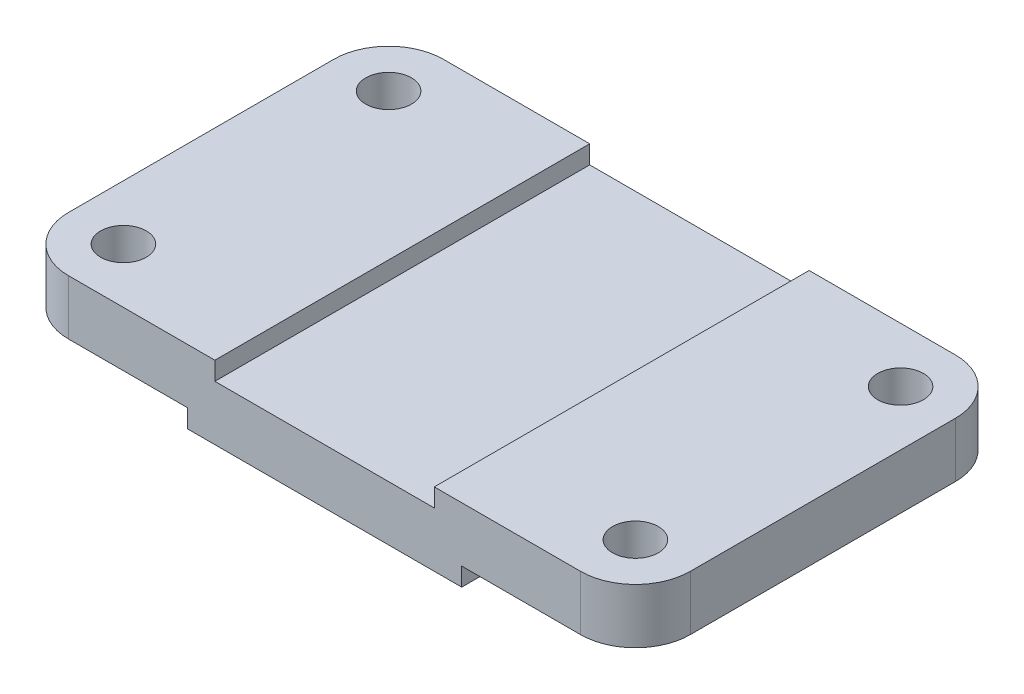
ISO-10303-21;
HEADER;
FILE_DESCRIPTION(('STEP AP214'),'2;1');
FILE_NAME('part.step','',(''),(''),'','','');
FILE_SCHEMA(('AUTOMOTIVE_DESIGN { 1 0 10303 214 1 1 1 1 }'));
ENDSEC;
DATA;
#1=APPLICATION_CONTEXT('core data for automotive mechanical design processes');
#2=APPLICATION_PROTOCOL_DEFINITION('international standard','automotive_design',2000,#1);
#3=PRODUCT_CONTEXT('',#1,'mechanical');
#4=PRODUCT('Part','Part','',(#3));
#5=PRODUCT_RELATED_PRODUCT_CATEGORY('part','',(#4));
#6=PRODUCT_DEFINITION_FORMATION('','',#4);
#7=PRODUCT_DEFINITION_CONTEXT('part definition',#1,'design');
#8=PRODUCT_DEFINITION('design','',#6,#7);
#9=PRODUCT_DEFINITION_SHAPE('','',#8);
#10=(LENGTH_UNIT() NAMED_UNIT(*) SI_UNIT(.MILLI.,.METRE.));
#11=(NAMED_UNIT(*) PLANE_ANGLE_UNIT() SI_UNIT($,.RADIAN.));
#12=(NAMED_UNIT(*) SI_UNIT($,.STERADIAN.) SOLID_ANGLE_UNIT());
#13=UNCERTAINTY_MEASURE_WITH_UNIT(LENGTH_MEASURE(1.E-05),#10,'distance_accuracy_value','');
#14=(GEOMETRIC_REPRESENTATION_CONTEXT(3) GLOBAL_UNCERTAINTY_ASSIGNED_CONTEXT((#13)) GLOBAL_UNIT_ASSIGNED_CONTEXT((#10,
#11,#12)) REPRESENTATION_CONTEXT('',''));
#15=CARTESIAN_POINT('',(0.,0.,0.));
#16=DIRECTION('',(0.,0.,1.));
#17=DIRECTION('',(1.,0.,0.));
#18=AXIS2_PLACEMENT_3D('',#15,#16,#17);
#19=CARTESIAN_POINT('',(30.,0.,41.));
#20=DIRECTION('',(-1.,0.,0.));
#21=DIRECTION('',(0.,0.,1.));
#22=AXIS2_PLACEMENT_3D('',#19,#20,#21);
#23=PLANE('',#22);
#24=DIRECTION('',(0.,1.,0.));
#25=VECTOR('',#24,1.);
#26=CARTESIAN_POINT('',(30.,0.,-41.));
#27=LINE('',#26,#25);
#28=CARTESIAN_POINT('',(30.,0.,-41.));
#29=VERTEX_POINT('',#28);
#30=CARTESIAN_POINT('',(30.,4.,-41.));
#31=VERTEX_POINT('',#30);
#32=EDGE_CURVE('E154',#29,#31,#27,.T.);
#33=ORIENTED_EDGE('',*,*,#32,.T.);
#34=DIRECTION('',(0.,0.,-1.));
#35=VECTOR('',#34,1.);
#36=CARTESIAN_POINT('',(30.,4.,41.));
#37=LINE('',#36,#35);
#38=CARTESIAN_POINT('',(30.,4.,41.));
#39=VERTEX_POINT('',#38);
#40=EDGE_CURVE('E162',#39,#31,#37,.T.);
#41=ORIENTED_EDGE('',*,*,#40,.F.);
#42=DIRECTION('',(0.,1.,0.));
#43=VECTOR('',#42,1.);
#44=CARTESIAN_POINT('',(30.,0.,41.));
#45=LINE('',#44,#43);
#46=CARTESIAN_POINT('',(30.,0.,41.));
#47=VERTEX_POINT('',#46);
#48=EDGE_CURVE('E198',#47,#39,#45,.T.);
#49=ORIENTED_EDGE('',*,*,#48,.F.);
#50=DIRECTION('',(0.,0.,-1.));
#51=VECTOR('',#50,1.);
#52=CARTESIAN_POINT('',(30.,0.,41.));
#53=LINE('',#52,#51);
#54=EDGE_CURVE('E175',#47,#29,#53,.T.);
#55=ORIENTED_EDGE('',*,*,#54,.T.);
#56=EDGE_LOOP('',(#33,#41,#49,#55));
#57=FACE_BOUND('',#56,.T.);
#58=ADVANCED_FACE('F34',(#57),#23,.F.);
#59=CARTESIAN_POINT('',(30.,4.,41.));
#60=DIRECTION('',(0.,1.,0.));
#61=DIRECTION('',(0.,0.,1.));
#62=AXIS2_PLACEMENT_3D('',#59,#60,#61);
#63=PLANE('',#62);
#64=CARTESIAN_POINT('',(56.,4.,29.));
#65=DIRECTION('',(0.,1.,0.));
#66=DIRECTION('',(0.,0.,1.));
#67=AXIS2_PLACEMENT_3D('',#64,#65,#66);
#68=CIRCLE('',#67,5.);
#69=CARTESIAN_POINT('',(56.,4.,34.));
#70=VERTEX_POINT('',#69);
#71=EDGE_CURVE('E283',#70,#70,#68,.T.);
#72=ORIENTED_EDGE('',*,*,#71,.T.);
#73=EDGE_LOOP('',(#72));
#74=FACE_BOUND('',#73,.T.);
#75=CARTESIAN_POINT('',(56.,4.,-29.));
#76=DIRECTION('',(0.,1.,0.));
#77=DIRECTION('',(0.,0.,1.));
#78=AXIS2_PLACEMENT_3D('',#75,#76,#77);
#79=CIRCLE('',#78,5.);
#80=CARTESIAN_POINT('',(56.,4.,-24.));
#81=VERTEX_POINT('',#80);
#82=EDGE_CURVE('E176',#81,#81,#79,.T.);
#83=ORIENTED_EDGE('',*,*,#82,.T.);
#84=EDGE_LOOP('',(#83));
#85=FACE_BOUND('',#84,.T.);
#86=DIRECTION('',(0.,0.,-1.));
#87=VECTOR('',#86,1.);
#88=CARTESIAN_POINT('',(68.,4.,41.));
#89=LINE('',#88,#87);
#90=CARTESIAN_POINT('',(68.,4.,29.));
#91=VERTEX_POINT('',#90);
#92=CARTESIAN_POINT('',(68.,4.,-29.));
#93=VERTEX_POINT('',#92);
#94=EDGE_CURVE('E171',#91,#93,#89,.T.);
#95=ORIENTED_EDGE('',*,*,#94,.F.);
#96=CARTESIAN_POINT('',(56.,4.,29.));
#97=DIRECTION('',(0.,1.,0.));
#98=DIRECTION('',(0.,0.,1.));
#99=AXIS2_PLACEMENT_3D('',#96,#97,#98);
#100=CIRCLE('',#99,12.);
#101=CARTESIAN_POINT('',(56.,4.,41.));
#102=VERTEX_POINT('',#101);
#103=EDGE_CURVE('E263',#91,#102,#100,.F.);
#104=ORIENTED_EDGE('',*,*,#103,.T.);
#105=DIRECTION('',(1.,0.,0.));
#106=VECTOR('',#105,1.);
#107=CARTESIAN_POINT('',(30.,4.,41.));
#108=LINE('',#107,#106);
#109=EDGE_CURVE('E166',#39,#102,#108,.T.);
#110=ORIENTED_EDGE('',*,*,#109,.F.);
#111=ORIENTED_EDGE('',*,*,#40,.T.);
#112=DIRECTION('',(1.,0.,0.));
#113=VECTOR('',#112,1.);
#114=CARTESIAN_POINT('',(30.,4.,-41.));
#115=LINE('',#114,#113);
#116=CARTESIAN_POINT('',(56.,4.,-41.));
#117=VERTEX_POINT('',#116);
#118=EDGE_CURVE('E148',#31,#117,#115,.T.);
#119=ORIENTED_EDGE('',*,*,#118,.T.);
#120=CARTESIAN_POINT('',(56.,4.,-29.));
#121=DIRECTION('',(0.,1.,0.));
#122=DIRECTION('',(0.,0.,1.));
#123=AXIS2_PLACEMENT_3D('',#120,#121,#122);
#124=CIRCLE('',#123,12.);
#125=EDGE_CURVE('E261',#117,#93,#124,.F.);
#126=ORIENTED_EDGE('',*,*,#125,.T.);
#127=EDGE_LOOP('',(#95,#104,#110,#111,#119,#126));
#128=FACE_BOUND('',#127,.T.);
#129=ADVANCED_FACE('F164',(#74,#85,#128),#63,.F.);
#130=CARTESIAN_POINT('',(68.,4.,41.));
#131=DIRECTION('',(-1.,0.,0.));
#132=DIRECTION('',(0.,0.,1.));
#133=AXIS2_PLACEMENT_3D('',#130,#131,#132);
#134=PLANE('',#133);
#135=DIRECTION('',(0.,0.,-1.));
#136=VECTOR('',#135,1.);
#137=CARTESIAN_POINT('',(68.,16.,41.));
#138=LINE('',#137,#136);
#139=CARTESIAN_POINT('',(68.,16.,29.));
#140=VERTEX_POINT('',#139);
#141=CARTESIAN_POINT('',(68.,16.,-29.));
#142=VERTEX_POINT('',#141);
#143=EDGE_CURVE('E242',#140,#142,#138,.T.);
#144=ORIENTED_EDGE('',*,*,#143,.F.);
#145=DIRECTION('',(0.,1.,0.));
#146=VECTOR('',#145,1.);
#147=CARTESIAN_POINT('',(68.,4.,29.));
#148=LINE('',#147,#146);
#149=EDGE_CURVE('E259',#140,#91,#148,.F.);
#150=ORIENTED_EDGE('',*,*,#149,.T.);
#151=ORIENTED_EDGE('',*,*,#94,.T.);
#152=DIRECTION('',(0.,1.,0.));
#153=VECTOR('',#152,1.);
#154=CARTESIAN_POINT('',(68.,16.,-29.));
#155=LINE('',#154,#153);
#156=EDGE_CURVE('E256',#93,#142,#155,.T.);
#157=ORIENTED_EDGE('',*,*,#156,.T.);
#158=EDGE_LOOP('',(#144,#150,#151,#157));
#159=FACE_BOUND('',#158,.T.);
#160=ADVANCED_FACE('F304',(#159),#134,.F.);
#161=CARTESIAN_POINT('',(68.,16.,41.));
#162=DIRECTION('',(0.,-1.,0.));
#163=DIRECTION('',(1.,0.,0.));
#164=AXIS2_PLACEMENT_3D('',#161,#162,#163);
#165=PLANE('',#164);
#166=CARTESIAN_POINT('',(56.,16.,29.));
#167=DIRECTION('',(0.,1.,0.));
#168=DIRECTION('',(-1.,0.,0.));
#169=AXIS2_PLACEMENT_3D('',#166,#167,#168);
#170=CIRCLE('',#169,5.);
#171=CARTESIAN_POINT('',(51.,16.,29.));
#172=VERTEX_POINT('',#171);
#173=EDGE_CURVE('E278',#172,#172,#170,.T.);
#174=ORIENTED_EDGE('',*,*,#173,.F.);
#175=EDGE_LOOP('',(#174));
#176=FACE_BOUND('',#175,.T.);
#177=CARTESIAN_POINT('',(56.,16.,-29.));
#178=DIRECTION('',(0.,1.,0.));
#179=DIRECTION('',(-1.,0.,0.));
#180=AXIS2_PLACEMENT_3D('',#177,#178,#179);
#181=CIRCLE('',#180,5.);
#182=CARTESIAN_POINT('',(51.,16.,-29.));
#183=VERTEX_POINT('',#182);
#184=EDGE_CURVE('E179',#183,#183,#181,.T.);
#185=ORIENTED_EDGE('',*,*,#184,.F.);
#186=EDGE_LOOP('',(#185));
#187=FACE_BOUND('',#186,.T.);
#188=DIRECTION('',(-1.,0.,0.));
#189=VECTOR('',#188,1.);
#190=CARTESIAN_POINT('',(68.,16.,41.));
#191=LINE('',#190,#189);
#192=CARTESIAN_POINT('',(56.,16.,41.));
#193=VERTEX_POINT('',#192);
#194=CARTESIAN_POINT('',(24.,16.,41.));
#195=VERTEX_POINT('',#194);
#196=EDGE_CURVE('E201',#193,#195,#191,.T.);
#197=ORIENTED_EDGE('',*,*,#196,.F.);
#198=CARTESIAN_POINT('',(56.,16.,29.));
#199=DIRECTION('',(0.,-1.,0.));
#200=DIRECTION('',(1.,0.,0.));
#201=AXIS2_PLACEMENT_3D('',#198,#199,#200);
#202=CIRCLE('',#201,12.);
#203=EDGE_CURVE('E254',#193,#140,#202,.F.);
#204=ORIENTED_EDGE('',*,*,#203,.T.);
#205=ORIENTED_EDGE('',*,*,#143,.T.);
#206=CARTESIAN_POINT('',(56.,16.,-29.));
#207=DIRECTION('',(0.,-1.,0.));
#208=DIRECTION('',(1.,0.,0.));
#209=AXIS2_PLACEMENT_3D('',#206,#207,#208);
#210=CIRCLE('',#209,12.);
#211=CARTESIAN_POINT('',(56.,16.,-41.));
#212=VERTEX_POINT('',#211);
#213=EDGE_CURVE('E252',#142,#212,#210,.F.);
#214=ORIENTED_EDGE('',*,*,#213,.T.);
#215=DIRECTION('',(-1.,0.,0.));
#216=VECTOR('',#215,1.);
#217=CARTESIAN_POINT('',(68.,16.,-41.));
#218=LINE('',#217,#216);
#219=CARTESIAN_POINT('',(24.,16.,-41.));
#220=VERTEX_POINT('',#219);
#221=EDGE_CURVE('E159',#212,#220,#218,.T.);
#222=ORIENTED_EDGE('',*,*,#221,.T.);
#223=DIRECTION('',(0.,0.,-1.));
#224=VECTOR('',#223,1.);
#225=CARTESIAN_POINT('',(24.,16.,41.));
#226=LINE('',#225,#224);
#227=EDGE_CURVE('E239',#195,#220,#226,.T.);
#228=ORIENTED_EDGE('',*,*,#227,.F.);
#229=EDGE_LOOP('',(#197,#204,#205,#214,#222,#228));
#230=FACE_BOUND('',#229,.T.);
#231=ADVANCED_FACE('F300',(#176,#187,#230),#165,.F.);
#232=CARTESIAN_POINT('',(24.,16.,41.));
#233=DIRECTION('',(1.,0.,0.));
#234=DIRECTION('',(0.,1.,0.));
#235=AXIS2_PLACEMENT_3D('',#232,#233,#234);
#236=PLANE('',#235);
#237=DIRECTION('',(0.,-1.,0.));
#238=VECTOR('',#237,1.);
#239=CARTESIAN_POINT('',(24.,16.,-41.));
#240=LINE('',#239,#238);
#241=CARTESIAN_POINT('',(24.,12.,-41.));
#242=VERTEX_POINT('',#241);
#243=EDGE_CURVE('E184',#220,#242,#240,.T.);
#244=ORIENTED_EDGE('',*,*,#243,.T.);
#245=DIRECTION('',(0.,0.,-1.));
#246=VECTOR('',#245,1.);
#247=CARTESIAN_POINT('',(24.,12.,41.));
#248=LINE('',#247,#246);
#249=CARTESIAN_POINT('',(24.,12.,41.));
#250=VERTEX_POINT('',#249);
#251=EDGE_CURVE('E236',#250,#242,#248,.T.);
#252=ORIENTED_EDGE('',*,*,#251,.F.);
#253=DIRECTION('',(0.,-1.,0.));
#254=VECTOR('',#253,1.);
#255=CARTESIAN_POINT('',(24.,16.,41.));
#256=LINE('',#255,#254);
#257=EDGE_CURVE('E203',#195,#250,#256,.T.);
#258=ORIENTED_EDGE('',*,*,#257,.F.);
#259=ORIENTED_EDGE('',*,*,#227,.T.);
#260=EDGE_LOOP('',(#244,#252,#258,#259));
#261=FACE_BOUND('',#260,.T.);
#262=ADVANCED_FACE('F303',(#261),#236,.F.);
#263=CARTESIAN_POINT('',(24.,12.,41.));
#264=DIRECTION('',(0.,-1.,0.));
#265=DIRECTION('',(0.,0.,-1.));
#266=AXIS2_PLACEMENT_3D('',#263,#264,#265);
#267=PLANE('',#266);
#268=DIRECTION('',(-1.,0.,0.));
#269=VECTOR('',#268,1.);
#270=CARTESIAN_POINT('',(24.,12.,-41.));
#271=LINE('',#270,#269);
#272=CARTESIAN_POINT('',(-24.,12.,-41.));
#273=VERTEX_POINT('',#272);
#274=EDGE_CURVE('E186',#242,#273,#271,.T.);
#275=ORIENTED_EDGE('',*,*,#274,.T.);
#276=DIRECTION('',(0.,0.,-1.));
#277=VECTOR('',#276,1.);
#278=CARTESIAN_POINT('',(-24.,12.,41.));
#279=LINE('',#278,#277);
#280=CARTESIAN_POINT('',(-24.,12.,41.));
#281=VERTEX_POINT('',#280);
#282=EDGE_CURVE('E233',#281,#273,#279,.T.);
#283=ORIENTED_EDGE('',*,*,#282,.F.);
#284=DIRECTION('',(-1.,0.,0.));
#285=VECTOR('',#284,1.);
#286=CARTESIAN_POINT('',(24.,12.,41.));
#287=LINE('',#286,#285);
#288=EDGE_CURVE('E205',#250,#281,#287,.T.);
#289=ORIENTED_EDGE('',*,*,#288,.F.);
#290=ORIENTED_EDGE('',*,*,#251,.T.);
#291=EDGE_LOOP('',(#275,#283,#289,#290));
#292=FACE_BOUND('',#291,.T.);
#293=ADVANCED_FACE('F329',(#292),#267,.F.);
#294=CARTESIAN_POINT('',(-24.,16.,41.));
#295=DIRECTION('',(-1.,0.,0.));
#296=DIRECTION('',(0.,-1.,0.));
#297=AXIS2_PLACEMENT_3D('',#294,#295,#296);
#298=PLANE('',#297);
#299=DIRECTION('',(0.,1.,0.));
#300=VECTOR('',#299,1.);
#301=CARTESIAN_POINT('',(-24.,16.,-41.));
#302=LINE('',#301,#300);
#303=CARTESIAN_POINT('',(-24.,16.,-41.));
#304=VERTEX_POINT('',#303);
#305=EDGE_CURVE('E188',#273,#304,#302,.T.);
#306=ORIENTED_EDGE('',*,*,#305,.T.);
#307=DIRECTION('',(0.,0.,-1.));
#308=VECTOR('',#307,1.);
#309=CARTESIAN_POINT('',(-24.,16.,41.));
#310=LINE('',#309,#308);
#311=CARTESIAN_POINT('',(-24.,16.,41.));
#312=VERTEX_POINT('',#311);
#313=EDGE_CURVE('E230',#312,#304,#310,.T.);
#314=ORIENTED_EDGE('',*,*,#313,.F.);
#315=DIRECTION('',(0.,1.,0.));
#316=VECTOR('',#315,1.);
#317=CARTESIAN_POINT('',(-24.,16.,41.));
#318=LINE('',#317,#316);
#319=EDGE_CURVE('E207',#281,#312,#318,.T.);
#320=ORIENTED_EDGE('',*,*,#319,.F.);
#321=ORIENTED_EDGE('',*,*,#282,.T.);
#322=EDGE_LOOP('',(#306,#314,#320,#321));
#323=FACE_BOUND('',#322,.T.);
#324=ADVANCED_FACE('F336',(#323),#298,.F.);
#325=CARTESIAN_POINT('',(-24.,16.,41.));
#326=DIRECTION('',(0.,-1.,0.));
#327=DIRECTION('',(1.,0.,0.));
#328=AXIS2_PLACEMENT_3D('',#325,#326,#327);
#329=PLANE('',#328);
#330=CARTESIAN_POINT('',(-56.,16.,29.));
#331=DIRECTION('',(0.,1.,0.));
#332=DIRECTION('',(-1.,0.,0.));
#333=AXIS2_PLACEMENT_3D('',#330,#331,#332);
#334=CIRCLE('',#333,5.);
#335=CARTESIAN_POINT('',(-61.,16.,29.));
#336=VERTEX_POINT('',#335);
#337=EDGE_CURVE('E290',#336,#336,#334,.T.);
#338=ORIENTED_EDGE('',*,*,#337,.F.);
#339=EDGE_LOOP('',(#338));
#340=FACE_BOUND('',#339,.T.);
#341=CARTESIAN_POINT('',(-56.,16.,-29.));
#342=DIRECTION('',(0.,1.,0.));
#343=DIRECTION('',(-1.,0.,0.));
#344=AXIS2_PLACEMENT_3D('',#341,#342,#343);
#345=CIRCLE('',#344,5.);
#346=CARTESIAN_POINT('',(-61.,16.,-29.));
#347=VERTEX_POINT('',#346);
#348=EDGE_CURVE('E279',#347,#347,#345,.T.);
#349=ORIENTED_EDGE('',*,*,#348,.F.);
#350=EDGE_LOOP('',(#349));
#351=FACE_BOUND('',#350,.T.);
#352=DIRECTION('',(-1.,0.,0.));
#353=VECTOR('',#352,1.);
#354=CARTESIAN_POINT('',(-24.,16.,-41.));
#355=LINE('',#354,#353);
#356=CARTESIAN_POINT('',(-56.,16.,-41.));
#357=VERTEX_POINT('',#356);
#358=EDGE_CURVE('E190',#304,#357,#355,.T.);
#359=ORIENTED_EDGE('',*,*,#358,.T.);
#360=CARTESIAN_POINT('',(-56.,16.,-29.));
#361=DIRECTION('',(0.,-1.,0.));
#362=DIRECTION('',(1.,0.,0.));
#363=AXIS2_PLACEMENT_3D('',#360,#361,#362);
#364=CIRCLE('',#363,12.);
#365=CARTESIAN_POINT('',(-68.,16.,-29.));
#366=VERTEX_POINT('',#365);
#367=EDGE_CURVE('E11',#357,#366,#364,.F.);
#368=ORIENTED_EDGE('',*,*,#367,.T.);
#369=DIRECTION('',(0.,0.,-1.));
#370=VECTOR('',#369,1.);
#371=CARTESIAN_POINT('',(-68.,16.,41.));
#372=LINE('',#371,#370);
#373=CARTESIAN_POINT('',(-68.,16.,29.));
#374=VERTEX_POINT('',#373);
#375=EDGE_CURVE('E228',#374,#366,#372,.T.);
#376=ORIENTED_EDGE('',*,*,#375,.F.);
#377=CARTESIAN_POINT('',(-56.,16.,29.));
#378=DIRECTION('',(0.,-1.,0.));
#379=DIRECTION('',(1.,0.,0.));
#380=AXIS2_PLACEMENT_3D('',#377,#378,#379);
#381=CIRCLE('',#380,12.);
#382=CARTESIAN_POINT('',(-56.,16.,41.));
#383=VERTEX_POINT('',#382);
#384=EDGE_CURVE('E42',#374,#383,#381,.F.);
#385=ORIENTED_EDGE('',*,*,#384,.T.);
#386=DIRECTION('',(-1.,0.,0.));
#387=VECTOR('',#386,1.);
#388=CARTESIAN_POINT('',(-24.,16.,41.));
#389=LINE('',#388,#387);
#390=EDGE_CURVE('E209',#312,#383,#389,.T.);
#391=ORIENTED_EDGE('',*,*,#390,.F.);
#392=ORIENTED_EDGE('',*,*,#313,.T.);
#393=EDGE_LOOP('',(#359,#368,#376,#385,#391,#392));
#394=FACE_BOUND('',#393,.T.);
#395=ADVANCED_FACE('F338',(#340,#351,#394),#329,.F.);
#396=CARTESIAN_POINT('',(-68.,4.,41.));
#397=DIRECTION('',(1.,0.,0.));
#398=DIRECTION('',(0.,0.,-1.));
#399=AXIS2_PLACEMENT_3D('',#396,#397,#398);
#400=PLANE('',#399);
#401=ORIENTED_EDGE('',*,*,#375,.T.);
#402=DIRECTION('',(0.,-1.,0.));
#403=VECTOR('',#402,1.);
#404=CARTESIAN_POINT('',(-68.,4.,-29.));
#405=LINE('',#404,#403);
#406=CARTESIAN_POINT('',(-68.,4.,-29.));
#407=VERTEX_POINT('',#406);
#408=EDGE_CURVE('E269',#366,#407,#405,.T.);
#409=ORIENTED_EDGE('',*,*,#408,.T.);
#410=DIRECTION('',(0.,0.,-1.));
#411=VECTOR('',#410,1.);
#412=CARTESIAN_POINT('',(-68.,4.,41.));
#413=LINE('',#412,#411);
#414=CARTESIAN_POINT('',(-68.,4.,29.));
#415=VERTEX_POINT('',#414);
#416=EDGE_CURVE('E225',#415,#407,#413,.T.);
#417=ORIENTED_EDGE('',*,*,#416,.F.);
#418=DIRECTION('',(0.,-1.,0.));
#419=VECTOR('',#418,1.);
#420=CARTESIAN_POINT('',(-68.,4.,29.));
#421=LINE('',#420,#419);
#422=EDGE_CURVE('E55',#415,#374,#421,.F.);
#423=ORIENTED_EDGE('',*,*,#422,.T.);
#424=EDGE_LOOP('',(#401,#409,#417,#423));
#425=FACE_BOUND('',#424,.T.);
#426=ADVANCED_FACE('F359',(#425),#400,.F.);
#427=CARTESIAN_POINT('',(-30.,4.,41.));
#428=DIRECTION('',(0.,1.,0.));
#429=DIRECTION('',(0.,0.,1.));
#430=AXIS2_PLACEMENT_3D('',#427,#428,#429);
#431=PLANE('',#430);
#432=CARTESIAN_POINT('',(-56.,4.,29.));
#433=DIRECTION('',(0.,1.,0.));
#434=DIRECTION('',(0.,0.,1.));
#435=AXIS2_PLACEMENT_3D('',#432,#433,#434);
#436=CIRCLE('',#435,5.);
#437=CARTESIAN_POINT('',(-56.,4.,34.));
#438=VERTEX_POINT('',#437);
#439=EDGE_CURVE('E37',#438,#438,#436,.T.);
#440=ORIENTED_EDGE('',*,*,#439,.T.);
#441=EDGE_LOOP('',(#440));
#442=FACE_BOUND('',#441,.T.);
#443=CARTESIAN_POINT('',(-56.,4.,-29.));
#444=DIRECTION('',(0.,1.,0.));
#445=DIRECTION('',(0.,0.,1.));
#446=AXIS2_PLACEMENT_3D('',#443,#444,#445);
#447=CIRCLE('',#446,5.);
#448=CARTESIAN_POINT('',(-56.,4.,-24.));
#449=VERTEX_POINT('',#448);
#450=EDGE_CURVE('E276',#449,#449,#447,.T.);
#451=ORIENTED_EDGE('',*,*,#450,.T.);
#452=EDGE_LOOP('',(#451));
#453=FACE_BOUND('',#452,.T.);
#454=ORIENTED_EDGE('',*,*,#416,.T.);
#455=CARTESIAN_POINT('',(-56.,4.,-29.));
#456=DIRECTION('',(0.,1.,0.));
#457=DIRECTION('',(0.,0.,1.));
#458=AXIS2_PLACEMENT_3D('',#455,#456,#457);
#459=CIRCLE('',#458,12.);
#460=CARTESIAN_POINT('',(-56.,4.,-41.));
#461=VERTEX_POINT('',#460);
#462=EDGE_CURVE('E274',#407,#461,#459,.F.);
#463=ORIENTED_EDGE('',*,*,#462,.T.);
#464=DIRECTION('',(1.,0.,0.));
#465=VECTOR('',#464,1.);
#466=CARTESIAN_POINT('',(-30.,4.,-41.));
#467=LINE('',#466,#465);
#468=CARTESIAN_POINT('',(-30.,4.,-41.));
#469=VERTEX_POINT('',#468);
#470=EDGE_CURVE('E192',#461,#469,#467,.T.);
#471=ORIENTED_EDGE('',*,*,#470,.T.);
#472=DIRECTION('',(0.,0.,-1.));
#473=VECTOR('',#472,1.);
#474=CARTESIAN_POINT('',(-30.,4.,41.));
#475=LINE('',#474,#473);
#476=CARTESIAN_POINT('',(-30.,4.,41.));
#477=VERTEX_POINT('',#476);
#478=EDGE_CURVE('E222',#477,#469,#475,.T.);
#479=ORIENTED_EDGE('',*,*,#478,.F.);
#480=DIRECTION('',(1.,0.,0.));
#481=VECTOR('',#480,1.);
#482=CARTESIAN_POINT('',(-30.,4.,41.));
#483=LINE('',#482,#481);
#484=CARTESIAN_POINT('',(-56.,4.,41.));
#485=VERTEX_POINT('',#484);
#486=EDGE_CURVE('E212',#485,#477,#483,.T.);
#487=ORIENTED_EDGE('',*,*,#486,.F.);
#488=CARTESIAN_POINT('',(-56.,4.,29.));
#489=DIRECTION('',(0.,1.,0.));
#490=DIRECTION('',(0.,0.,1.));
#491=AXIS2_PLACEMENT_3D('',#488,#489,#490);
#492=CIRCLE('',#491,12.);
#493=EDGE_CURVE('E272',#485,#415,#492,.F.);
#494=ORIENTED_EDGE('',*,*,#493,.T.);
#495=EDGE_LOOP('',(#454,#463,#471,#479,#487,#494));
#496=FACE_BOUND('',#495,.T.);
#497=ADVANCED_FACE('F345',(#442,#453,#496),#431,.F.);
#498=CARTESIAN_POINT('',(-30.,0.,41.));
#499=DIRECTION('',(1.,0.,0.));
#500=DIRECTION('',(0.,0.,-1.));
#501=AXIS2_PLACEMENT_3D('',#498,#499,#500);
#502=PLANE('',#501);
#503=DIRECTION('',(0.,-1.,0.));
#504=VECTOR('',#503,1.);
#505=CARTESIAN_POINT('',(-30.,0.,-41.));
#506=LINE('',#505,#504);
#507=CARTESIAN_POINT('',(-30.,0.,-41.));
#508=VERTEX_POINT('',#507);
#509=EDGE_CURVE('E194',#469,#508,#506,.T.);
#510=ORIENTED_EDGE('',*,*,#509,.T.);
#511=DIRECTION('',(0.,0.,-1.));
#512=VECTOR('',#511,1.);
#513=CARTESIAN_POINT('',(-30.,0.,41.));
#514=LINE('',#513,#512);
#515=CARTESIAN_POINT('',(-30.,0.,41.));
#516=VERTEX_POINT('',#515);
#517=EDGE_CURVE('E219',#516,#508,#514,.T.);
#518=ORIENTED_EDGE('',*,*,#517,.F.);
#519=DIRECTION('',(0.,-1.,0.));
#520=VECTOR('',#519,1.);
#521=CARTESIAN_POINT('',(-30.,0.,41.));
#522=LINE('',#521,#520);
#523=EDGE_CURVE('E214',#477,#516,#522,.T.);
#524=ORIENTED_EDGE('',*,*,#523,.F.);
#525=ORIENTED_EDGE('',*,*,#478,.T.);
#526=EDGE_LOOP('',(#510,#518,#524,#525));
#527=FACE_BOUND('',#526,.T.);
#528=ADVANCED_FACE('F351',(#527),#502,.F.);
#529=CARTESIAN_POINT('',(-30.,0.,41.));
#530=DIRECTION('',(0.,1.,0.));
#531=DIRECTION('',(0.,0.,1.));
#532=AXIS2_PLACEMENT_3D('',#529,#530,#531);
#533=PLANE('',#532);
#534=DIRECTION('',(1.,0.,0.));
#535=VECTOR('',#534,1.);
#536=CARTESIAN_POINT('',(-30.,0.,-41.));
#537=LINE('',#536,#535);
#538=EDGE_CURVE('E196',#508,#29,#537,.T.);
#539=ORIENTED_EDGE('',*,*,#538,.T.);
#540=ORIENTED_EDGE('',*,*,#54,.F.);
#541=DIRECTION('',(1.,0.,0.));
#542=VECTOR('',#541,1.);
#543=CARTESIAN_POINT('',(-30.,0.,41.));
#544=LINE('',#543,#542);
#545=EDGE_CURVE('E216',#516,#47,#544,.T.);
#546=ORIENTED_EDGE('',*,*,#545,.F.);
#547=ORIENTED_EDGE('',*,*,#517,.T.);
#548=EDGE_LOOP('',(#539,#540,#546,#547));
#549=FACE_BOUND('',#548,.T.);
#550=ADVANCED_FACE('F354',(#549),#533,.F.);
#551=CARTESIAN_POINT('',(30.,4.,41.));
#552=DIRECTION('',(0.,0.,-1.));
#553=DIRECTION('',(-1.,0.,0.));
#554=AXIS2_PLACEMENT_3D('',#551,#552,#553);
#555=PLANE('',#554);
#556=ORIENTED_EDGE('',*,*,#109,.T.);
#557=DIRECTION('',(0.,1.,0.));
#558=VECTOR('',#557,1.);
#559=CARTESIAN_POINT('',(56.,4.,41.));
#560=LINE('',#559,#558);
#561=EDGE_CURVE('E249',#102,#193,#560,.T.);
#562=ORIENTED_EDGE('',*,*,#561,.T.);
#563=ORIENTED_EDGE('',*,*,#196,.T.);
#564=ORIENTED_EDGE('',*,*,#257,.T.);
#565=ORIENTED_EDGE('',*,*,#288,.T.);
#566=ORIENTED_EDGE('',*,*,#319,.T.);
#567=ORIENTED_EDGE('',*,*,#390,.T.);
#568=DIRECTION('',(0.,-1.,0.));
#569=VECTOR('',#568,1.);
#570=CARTESIAN_POINT('',(-56.,4.,41.));
#571=LINE('',#570,#569);
#572=EDGE_CURVE('E170',#383,#485,#571,.T.);
#573=ORIENTED_EDGE('',*,*,#572,.T.);
#574=ORIENTED_EDGE('',*,*,#486,.T.);
#575=ORIENTED_EDGE('',*,*,#523,.T.);
#576=ORIENTED_EDGE('',*,*,#545,.T.);
#577=ORIENTED_EDGE('',*,*,#48,.T.);
#578=EDGE_LOOP('',(#556,#562,#563,#564,#565,#566,#567,#573,#574,#575,#576,#577));
#579=FACE_BOUND('',#578,.T.);
#580=ADVANCED_FACE('F312',(#579),#555,.F.);
#581=CARTESIAN_POINT('',(30.,4.,-41.));
#582=DIRECTION('',(0.,0.,-1.));
#583=DIRECTION('',(-1.,0.,0.));
#584=AXIS2_PLACEMENT_3D('',#581,#582,#583);
#585=PLANE('',#584);
#586=ORIENTED_EDGE('',*,*,#221,.F.);
#587=DIRECTION('',(0.,1.,0.));
#588=VECTOR('',#587,1.);
#589=CARTESIAN_POINT('',(56.,4.,-41.));
#590=LINE('',#589,#588);
#591=EDGE_CURVE('E156',#212,#117,#590,.F.);
#592=ORIENTED_EDGE('',*,*,#591,.T.);
#593=ORIENTED_EDGE('',*,*,#118,.F.);
#594=ORIENTED_EDGE('',*,*,#32,.F.);
#595=ORIENTED_EDGE('',*,*,#538,.F.);
#596=ORIENTED_EDGE('',*,*,#509,.F.);
#597=ORIENTED_EDGE('',*,*,#470,.F.);
#598=DIRECTION('',(0.,-1.,0.));
#599=VECTOR('',#598,1.);
#600=CARTESIAN_POINT('',(-56.,16.,-41.));
#601=LINE('',#600,#599);
#602=EDGE_CURVE('E265',#461,#357,#601,.F.);
#603=ORIENTED_EDGE('',*,*,#602,.T.);
#604=ORIENTED_EDGE('',*,*,#358,.F.);
#605=ORIENTED_EDGE('',*,*,#305,.F.);
#606=ORIENTED_EDGE('',*,*,#274,.F.);
#607=ORIENTED_EDGE('',*,*,#243,.F.);
#608=EDGE_LOOP('',(#586,#592,#593,#594,#595,#596,#597,#603,#604,#605,#606,#607));
#609=FACE_BOUND('',#608,.T.);
#610=ADVANCED_FACE('F151',(#609),#585,.T.);
#611=CARTESIAN_POINT('',(56.,4.,29.));
#612=DIRECTION('',(0.,1.,0.));
#613=DIRECTION('',(0.,0.,1.));
#614=AXIS2_PLACEMENT_3D('',#611,#612,#613);
#615=CYLINDRICAL_SURFACE('',#614,12.);
#616=ORIENTED_EDGE('',*,*,#103,.F.);
#617=ORIENTED_EDGE('',*,*,#149,.F.);
#618=ORIENTED_EDGE('',*,*,#203,.F.);
#619=ORIENTED_EDGE('',*,*,#561,.F.);
#620=EDGE_LOOP('',(#616,#617,#618,#619));
#621=FACE_BOUND('',#620,.T.);
#622=ADVANCED_FACE('F317',(#621),#615,.T.);
#623=CARTESIAN_POINT('',(56.,4.,-29.));
#624=DIRECTION('',(0.,-1.,0.));
#625=DIRECTION('',(0.,0.,-1.));
#626=AXIS2_PLACEMENT_3D('',#623,#624,#625);
#627=CYLINDRICAL_SURFACE('',#626,12.);
#628=ORIENTED_EDGE('',*,*,#125,.F.);
#629=ORIENTED_EDGE('',*,*,#591,.F.);
#630=ORIENTED_EDGE('',*,*,#213,.F.);
#631=ORIENTED_EDGE('',*,*,#156,.F.);
#632=EDGE_LOOP('',(#628,#629,#630,#631));
#633=FACE_BOUND('',#632,.T.);
#634=ADVANCED_FACE('F322',(#633),#627,.T.);
#635=CARTESIAN_POINT('',(-56.,4.,-29.));
#636=DIRECTION('',(0.,1.,0.));
#637=DIRECTION('',(0.,0.,1.));
#638=AXIS2_PLACEMENT_3D('',#635,#636,#637);
#639=CYLINDRICAL_SURFACE('',#638,12.);
#640=ORIENTED_EDGE('',*,*,#367,.F.);
#641=ORIENTED_EDGE('',*,*,#602,.F.);
#642=ORIENTED_EDGE('',*,*,#462,.F.);
#643=ORIENTED_EDGE('',*,*,#408,.F.);
#644=EDGE_LOOP('',(#640,#641,#642,#643));
#645=FACE_BOUND('',#644,.T.);
#646=ADVANCED_FACE('F357',(#645),#639,.T.);
#647=CARTESIAN_POINT('',(-56.,4.,29.));
#648=DIRECTION('',(0.,-1.,0.));
#649=DIRECTION('',(0.,0.,-1.));
#650=AXIS2_PLACEMENT_3D('',#647,#648,#649);
#651=CYLINDRICAL_SURFACE('',#650,12.);
#652=ORIENTED_EDGE('',*,*,#384,.F.);
#653=ORIENTED_EDGE('',*,*,#422,.F.);
#654=ORIENTED_EDGE('',*,*,#493,.F.);
#655=ORIENTED_EDGE('',*,*,#572,.F.);
#656=EDGE_LOOP('',(#652,#653,#654,#655));
#657=FACE_BOUND('',#656,.T.);
#658=ADVANCED_FACE('F341',(#657),#651,.T.);
#659=CARTESIAN_POINT('',(56.,0.,-29.));
#660=DIRECTION('',(0.,1.,0.));
#661=DIRECTION('',(-1.,0.,0.));
#662=AXIS2_PLACEMENT_3D('',#659,#660,#661);
#663=CYLINDRICAL_SURFACE('',#662,5.);
#664=ORIENTED_EDGE('',*,*,#184,.T.);
#665=EDGE_LOOP('',(#664));
#666=FACE_BOUND('',#665,.T.);
#667=ORIENTED_EDGE('',*,*,#82,.F.);
#668=EDGE_LOOP('',(#667));
#669=FACE_BOUND('',#668,.T.);
#670=ADVANCED_FACE('F297',(#666,#669),#663,.F.);
#671=CARTESIAN_POINT('',(56.,0.,29.));
#672=DIRECTION('',(0.,1.,0.));
#673=DIRECTION('',(-1.,0.,0.));
#674=AXIS2_PLACEMENT_3D('',#671,#672,#673);
#675=CYLINDRICAL_SURFACE('',#674,5.);
#676=ORIENTED_EDGE('',*,*,#173,.T.);
#677=EDGE_LOOP('',(#676));
#678=FACE_BOUND('',#677,.T.);
#679=ORIENTED_EDGE('',*,*,#71,.F.);
#680=EDGE_LOOP('',(#679));
#681=FACE_BOUND('',#680,.T.);
#682=ADVANCED_FACE('F416',(#678,#681),#675,.F.);
#683=CARTESIAN_POINT('',(-56.,0.,-29.));
#684=DIRECTION('',(0.,1.,0.));
#685=DIRECTION('',(-1.,0.,0.));
#686=AXIS2_PLACEMENT_3D('',#683,#684,#685);
#687=CYLINDRICAL_SURFACE('',#686,5.);
#688=ORIENTED_EDGE('',*,*,#348,.T.);
#689=EDGE_LOOP('',(#688));
#690=FACE_BOUND('',#689,.T.);
#691=ORIENTED_EDGE('',*,*,#450,.F.);
#692=EDGE_LOOP('',(#691));
#693=FACE_BOUND('',#692,.T.);
#694=ADVANCED_FACE('F427',(#690,#693),#687,.F.);
#695=CARTESIAN_POINT('',(-56.,0.,29.));
#696=DIRECTION('',(0.,1.,0.));
#697=DIRECTION('',(-1.,0.,0.));
#698=AXIS2_PLACEMENT_3D('',#695,#696,#697);
#699=CYLINDRICAL_SURFACE('',#698,5.);
#700=ORIENTED_EDGE('',*,*,#337,.T.);
#701=EDGE_LOOP('',(#700));
#702=FACE_BOUND('',#701,.T.);
#703=ORIENTED_EDGE('',*,*,#439,.F.);
#704=EDGE_LOOP('',(#703));
#705=FACE_BOUND('',#704,.T.);
#706=ADVANCED_FACE('F437',(#702,#705),#699,.F.);
#707=CLOSED_SHELL('',(#58,#129,#160,#231,#262,#293,#324,#395,#426,#497,#528,#550,#580,#610,#622,
#634,#646,#658,#670,#682,#694,#706));
#708=MANIFOLD_SOLID_BREP('B2',#707);
#709=ADVANCED_BREP_SHAPE_REPRESENTATION('',(#18,#708),#14);
#710=SHAPE_DEFINITION_REPRESENTATION(#9,#709);
ENDSEC;
END-ISO-10303-21;
